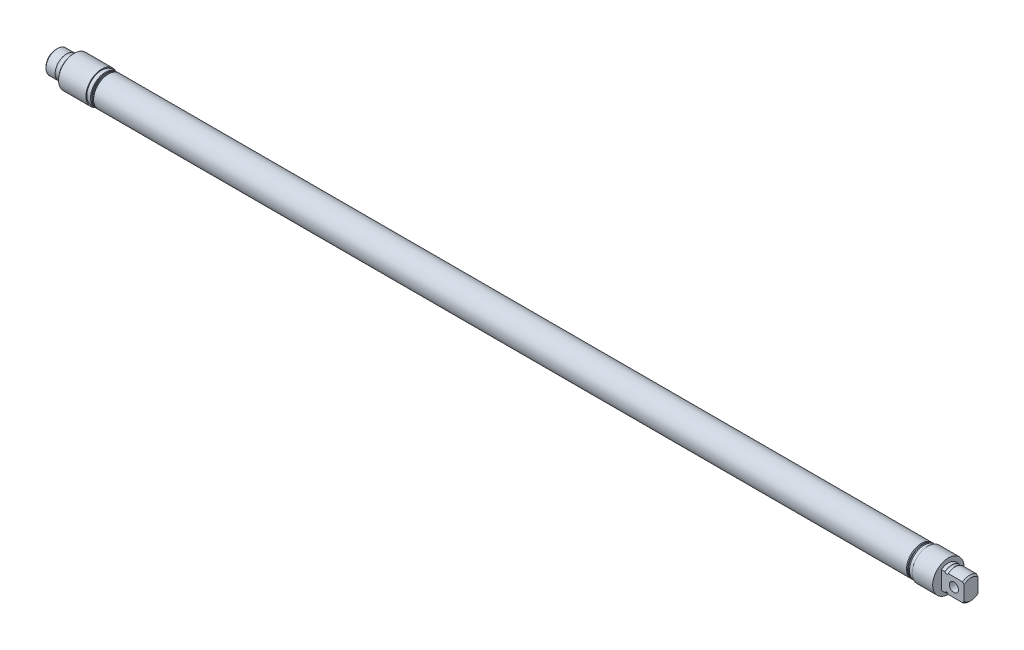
ISO-10303-21;
HEADER;
FILE_DESCRIPTION(('STEP AP214'),'2;1');
FILE_NAME('part.step','',(''),(''),'','','');
FILE_SCHEMA(('AUTOMOTIVE_DESIGN { 1 0 10303 214 1 1 1 1 }'));
ENDSEC;
DATA;
#1=APPLICATION_CONTEXT('core data for automotive mechanical design processes');
#2=APPLICATION_PROTOCOL_DEFINITION('international standard','automotive_design',2000,#1);
#3=PRODUCT_CONTEXT('',#1,'mechanical');
#4=PRODUCT('Part','Part','',(#3));
#5=PRODUCT_RELATED_PRODUCT_CATEGORY('part','',(#4));
#6=PRODUCT_DEFINITION_FORMATION('','',#4);
#7=PRODUCT_DEFINITION_CONTEXT('part definition',#1,'design');
#8=PRODUCT_DEFINITION('design','',#6,#7);
#9=PRODUCT_DEFINITION_SHAPE('','',#8);
#10=(LENGTH_UNIT() NAMED_UNIT(*) SI_UNIT(.MILLI.,.METRE.));
#11=(NAMED_UNIT(*) PLANE_ANGLE_UNIT() SI_UNIT($,.RADIAN.));
#12=(NAMED_UNIT(*) SI_UNIT($,.STERADIAN.) SOLID_ANGLE_UNIT());
#13=UNCERTAINTY_MEASURE_WITH_UNIT(LENGTH_MEASURE(1.E-05),#10,'distance_accuracy_value','');
#14=(GEOMETRIC_REPRESENTATION_CONTEXT(3) GLOBAL_UNCERTAINTY_ASSIGNED_CONTEXT((#13)) GLOBAL_UNIT_ASSIGNED_CONTEXT((#10,
#11,#12)) REPRESENTATION_CONTEXT('',''));
#15=CARTESIAN_POINT('',(0.,0.,0.));
#16=DIRECTION('',(0.,0.,1.));
#17=DIRECTION('',(1.,0.,0.));
#18=AXIS2_PLACEMENT_3D('',#15,#16,#17);
#19=CARTESIAN_POINT('',(-21.4174471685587,0.,0.));
#20=DIRECTION('',(-1.,0.,0.));
#21=DIRECTION('',(0.,0.,1.));
#22=AXIS2_PLACEMENT_3D('',#19,#20,#21);
#23=CYLINDRICAL_SURFACE('',#22,10.287);
#24=CARTESIAN_POINT('',(601.98,0.,0.));
#25=DIRECTION('',(-1.,0.,0.));
#26=DIRECTION('',(0.,0.,1.));
#27=AXIS2_PLACEMENT_3D('',#24,#25,#26);
#28=CIRCLE('',#27,10.2870000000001);
#29=CARTESIAN_POINT('',(601.98,0.,10.2870000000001));
#30=VERTEX_POINT('',#29);
#31=EDGE_CURVE('E356',#30,#30,#28,.T.);
#32=ORIENTED_EDGE('',*,*,#31,.F.);
#33=EDGE_LOOP('',(#32));
#34=FACE_BOUND('',#33,.T.);
#35=CARTESIAN_POINT('',(602.488,0.,0.));
#36=DIRECTION('',(-1.,0.,0.));
#37=DIRECTION('',(0.,0.,1.));
#38=AXIS2_PLACEMENT_3D('',#35,#36,#37);
#39=CIRCLE('',#38,10.2870000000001);
#40=CARTESIAN_POINT('',(602.488,0.,10.2870000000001));
#41=VERTEX_POINT('',#40);
#42=EDGE_CURVE('E345',#41,#41,#39,.T.);
#43=ORIENTED_EDGE('',*,*,#42,.T.);
#44=EDGE_LOOP('',(#43));
#45=FACE_BOUND('',#44,.T.);
#46=ADVANCED_FACE('F34',(#34,#45),#23,.T.);
#47=CARTESIAN_POINT('',(36.449,0.,0.));
#48=DIRECTION('',(-1.,0.,0.));
#49=DIRECTION('',(0.,0.,1.));
#50=AXIS2_PLACEMENT_3D('',#47,#48,#49);
#51=CIRCLE('',#50,10.287);
#52=CARTESIAN_POINT('',(36.449,0.,10.287));
#53=VERTEX_POINT('',#52);
#54=EDGE_CURVE('E240',#53,#53,#51,.T.);
#55=ORIENTED_EDGE('',*,*,#54,.F.);
#56=EDGE_LOOP('',(#55));
#57=FACE_BOUND('',#56,.T.);
#58=CARTESIAN_POINT('',(601.218,0.,0.));
#59=DIRECTION('',(-1.,0.,0.));
#60=DIRECTION('',(0.,0.,1.));
#61=AXIS2_PLACEMENT_3D('',#58,#59,#60);
#62=CIRCLE('',#61,10.2870000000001);
#63=CARTESIAN_POINT('',(601.218,0.,10.2870000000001));
#64=VERTEX_POINT('',#63);
#65=EDGE_CURVE('E359',#64,#64,#62,.T.);
#66=ORIENTED_EDGE('',*,*,#65,.T.);
#67=EDGE_LOOP('',(#66));
#68=FACE_BOUND('',#67,.T.);
#69=ADVANCED_FACE('F318',(#57,#68),#23,.T.);
#70=CARTESIAN_POINT('',(35.179,0.,0.));
#71=DIRECTION('',(-1.,0.,0.));
#72=DIRECTION('',(0.,0.,1.));
#73=AXIS2_PLACEMENT_3D('',#70,#71,#72);
#74=CIRCLE('',#73,10.287);
#75=CARTESIAN_POINT('',(35.179,0.,10.287));
#76=VERTEX_POINT('',#75);
#77=EDGE_CURVE('E249',#76,#76,#74,.T.);
#78=ORIENTED_EDGE('',*,*,#77,.F.);
#79=EDGE_LOOP('',(#78));
#80=FACE_BOUND('',#79,.T.);
#81=CARTESIAN_POINT('',(35.56,0.,0.));
#82=DIRECTION('',(-1.,0.,0.));
#83=DIRECTION('',(0.,0.,1.));
#84=AXIS2_PLACEMENT_3D('',#81,#82,#83);
#85=CIRCLE('',#84,10.287);
#86=CARTESIAN_POINT('',(35.56,0.,10.287));
#87=VERTEX_POINT('',#86);
#88=EDGE_CURVE('E246',#87,#87,#85,.T.);
#89=ORIENTED_EDGE('',*,*,#88,.T.);
#90=EDGE_LOOP('',(#89));
#91=FACE_BOUND('',#90,.T.);
#92=ADVANCED_FACE('F303',(#80,#91),#23,.T.);
#93=CARTESIAN_POINT('',(31.75,0.,0.));
#94=DIRECTION('',(-1.,0.,0.));
#95=DIRECTION('',(0.,0.,1.));
#96=AXIS2_PLACEMENT_3D('',#93,#94,#95);
#97=CIRCLE('',#96,10.287);
#98=CARTESIAN_POINT('',(31.75,0.,10.287));
#99=VERTEX_POINT('',#98);
#100=EDGE_CURVE('E264',#99,#99,#97,.T.);
#101=ORIENTED_EDGE('',*,*,#100,.F.);
#102=EDGE_LOOP('',(#101));
#103=FACE_BOUND('',#102,.T.);
#104=CARTESIAN_POINT('',(34.29,0.,0.));
#105=DIRECTION('',(-1.,0.,0.));
#106=DIRECTION('',(0.,0.,1.));
#107=AXIS2_PLACEMENT_3D('',#104,#105,#106);
#108=CIRCLE('',#107,10.287);
#109=CARTESIAN_POINT('',(34.29,0.,10.287));
#110=VERTEX_POINT('',#109);
#111=EDGE_CURVE('E255',#110,#110,#108,.T.);
#112=ORIENTED_EDGE('',*,*,#111,.T.);
#113=EDGE_LOOP('',(#112));
#114=FACE_BOUND('',#113,.T.);
#115=ADVANCED_FACE('F284',(#103,#114),#23,.T.);
#116=CARTESIAN_POINT('',(12.7,10.922,0.));
#117=DIRECTION('',(1.,0.,0.));
#118=DIRECTION('',(0.,0.,-1.));
#119=AXIS2_PLACEMENT_3D('',#116,#117,#118);
#120=PLANE('',#119);
#121=CARTESIAN_POINT('',(12.7,0.,0.));
#122=DIRECTION('',(-1.,0.,0.));
#123=DIRECTION('',(0.,0.,1.));
#124=AXIS2_PLACEMENT_3D('',#121,#122,#123);
#125=CIRCLE('',#124,7.9375);
#126=CARTESIAN_POINT('',(12.7,0.,7.9375));
#127=VERTEX_POINT('',#126);
#128=EDGE_CURVE('E144',#127,#127,#125,.T.);
#129=ORIENTED_EDGE('',*,*,#128,.F.);
#130=EDGE_LOOP('',(#129));
#131=FACE_BOUND('',#130,.T.);
#132=CARTESIAN_POINT('',(12.7,0.,0.));
#133=DIRECTION('',(-1.,0.,0.));
#134=DIRECTION('',(0.,0.,1.));
#135=AXIS2_PLACEMENT_3D('',#132,#133,#134);
#136=CIRCLE('',#135,10.922);
#137=CARTESIAN_POINT('',(12.7,0.,10.922));
#138=VERTEX_POINT('',#137);
#139=EDGE_CURVE('E258',#138,#138,#136,.T.);
#140=ORIENTED_EDGE('',*,*,#139,.T.);
#141=EDGE_LOOP('',(#140));
#142=FACE_BOUND('',#141,.T.);
#143=ADVANCED_FACE('F281',(#131,#142),#120,.F.);
#144=CARTESIAN_POINT('',(-21.4174471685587,0.,0.));
#145=DIRECTION('',(-1.,0.,0.));
#146=DIRECTION('',(0.,0.,1.));
#147=AXIS2_PLACEMENT_3D('',#144,#145,#146);
#148=CYLINDRICAL_SURFACE('',#147,7.9375);
#149=CARTESIAN_POINT('',(10.414,0.,0.));
#150=DIRECTION('',(-1.,0.,0.));
#151=DIRECTION('',(0.,0.,1.));
#152=AXIS2_PLACEMENT_3D('',#149,#150,#151);
#153=CIRCLE('',#152,7.9375);
#154=CARTESIAN_POINT('',(10.414,0.,7.9375));
#155=VERTEX_POINT('',#154);
#156=EDGE_CURVE('E362',#155,#155,#153,.T.);
#157=ORIENTED_EDGE('',*,*,#156,.F.);
#158=EDGE_LOOP('',(#157));
#159=FACE_BOUND('',#158,.T.);
#160=ORIENTED_EDGE('',*,*,#128,.T.);
#161=EDGE_LOOP('',(#160));
#162=FACE_BOUND('',#161,.T.);
#163=ADVANCED_FACE('F279',(#159,#162),#148,.T.);
#164=CARTESIAN_POINT('',(31.75,10.922,0.));
#165=DIRECTION('',(-1.,0.,0.));
#166=DIRECTION('',(0.,0.,1.));
#167=AXIS2_PLACEMENT_3D('',#164,#165,#166);
#168=PLANE('',#167);
#169=CARTESIAN_POINT('',(31.75,0.,0.));
#170=DIRECTION('',(-1.,0.,0.));
#171=DIRECTION('',(0.,0.,1.));
#172=AXIS2_PLACEMENT_3D('',#169,#170,#171);
#173=CIRCLE('',#172,10.922);
#174=CARTESIAN_POINT('',(31.75,0.,10.922));
#175=VERTEX_POINT('',#174);
#176=EDGE_CURVE('E261',#175,#175,#173,.T.);
#177=ORIENTED_EDGE('',*,*,#176,.F.);
#178=EDGE_LOOP('',(#177));
#179=FACE_BOUND('',#178,.T.);
#180=ORIENTED_EDGE('',*,*,#100,.T.);
#181=EDGE_LOOP('',(#180));
#182=FACE_BOUND('',#181,.T.);
#183=ADVANCED_FACE('F292',(#179,#182),#168,.F.);
#184=CARTESIAN_POINT('',(-21.4174471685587,0.,0.));
#185=DIRECTION('',(-1.,0.,0.));
#186=DIRECTION('',(0.,0.,1.));
#187=AXIS2_PLACEMENT_3D('',#184,#185,#186);
#188=CYLINDRICAL_SURFACE('',#187,10.922);
#189=ORIENTED_EDGE('',*,*,#139,.F.);
#190=EDGE_LOOP('',(#189));
#191=FACE_BOUND('',#190,.T.);
#192=ORIENTED_EDGE('',*,*,#176,.T.);
#193=EDGE_LOOP('',(#192));
#194=FACE_BOUND('',#193,.T.);
#195=ADVANCED_FACE('F288',(#191,#194),#188,.T.);
#196=CARTESIAN_POINT('',(34.29,10.287,0.));
#197=DIRECTION('',(1.,0.,0.));
#198=DIRECTION('',(0.,0.,-1.));
#199=AXIS2_PLACEMENT_3D('',#196,#197,#198);
#200=PLANE('',#199);
#201=CARTESIAN_POINT('',(34.29,0.,0.));
#202=DIRECTION('',(-1.,0.,0.));
#203=DIRECTION('',(0.,0.,1.));
#204=AXIS2_PLACEMENT_3D('',#201,#202,#203);
#205=CIRCLE('',#204,9.39799999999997);
#206=CARTESIAN_POINT('',(34.29,0.,9.39799999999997));
#207=VERTEX_POINT('',#206);
#208=EDGE_CURVE('E252',#207,#207,#205,.T.);
#209=ORIENTED_EDGE('',*,*,#208,.T.);
#210=EDGE_LOOP('',(#209));
#211=FACE_BOUND('',#210,.T.);
#212=ORIENTED_EDGE('',*,*,#111,.F.);
#213=EDGE_LOOP('',(#212));
#214=FACE_BOUND('',#213,.T.);
#215=ADVANCED_FACE('F291',(#211,#214),#200,.T.);
#216=CARTESIAN_POINT('',(34.29,0.,0.));
#217=DIRECTION('',(1.,0.,0.));
#218=DIRECTION('',(0.,0.,-1.));
#219=AXIS2_PLACEMENT_3D('',#216,#217,#218);
#220=CONICAL_SURFACE('',#219,9.39799999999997,0.785398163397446);
#221=ORIENTED_EDGE('',*,*,#77,.T.);
#222=EDGE_LOOP('',(#221));
#223=FACE_BOUND('',#222,.T.);
#224=ORIENTED_EDGE('',*,*,#208,.F.);
#225=EDGE_LOOP('',(#224));
#226=FACE_BOUND('',#225,.T.);
#227=ADVANCED_FACE('F308',(#223,#226),#220,.T.);
#228=CARTESIAN_POINT('',(35.56,10.287,0.));
#229=DIRECTION('',(1.,0.,0.));
#230=DIRECTION('',(0.,0.,-1.));
#231=AXIS2_PLACEMENT_3D('',#228,#229,#230);
#232=PLANE('',#231);
#233=CARTESIAN_POINT('',(35.56,0.,0.));
#234=DIRECTION('',(-1.,0.,0.));
#235=DIRECTION('',(0.,0.,1.));
#236=AXIS2_PLACEMENT_3D('',#233,#234,#235);
#237=CIRCLE('',#236,9.39799999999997);
#238=CARTESIAN_POINT('',(35.56,0.,9.39799999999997));
#239=VERTEX_POINT('',#238);
#240=EDGE_CURVE('E243',#239,#239,#237,.T.);
#241=ORIENTED_EDGE('',*,*,#240,.T.);
#242=EDGE_LOOP('',(#241));
#243=FACE_BOUND('',#242,.T.);
#244=ORIENTED_EDGE('',*,*,#88,.F.);
#245=EDGE_LOOP('',(#244));
#246=FACE_BOUND('',#245,.T.);
#247=ADVANCED_FACE('F314',(#243,#246),#232,.T.);
#248=CARTESIAN_POINT('',(35.56,0.,0.));
#249=DIRECTION('',(1.,0.,0.));
#250=DIRECTION('',(0.,0.,-1.));
#251=AXIS2_PLACEMENT_3D('',#248,#249,#250);
#252=CONICAL_SURFACE('',#251,9.39799999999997,0.785398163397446);
#253=ORIENTED_EDGE('',*,*,#54,.T.);
#254=EDGE_LOOP('',(#253));
#255=FACE_BOUND('',#254,.T.);
#256=ORIENTED_EDGE('',*,*,#240,.F.);
#257=EDGE_LOOP('',(#256));
#258=FACE_BOUND('',#257,.T.);
#259=ADVANCED_FACE('F476',(#255,#258),#252,.T.);
#260=CARTESIAN_POINT('',(8.89,0.,0.));
#261=DIRECTION('',(-1.,0.,0.));
#262=DIRECTION('',(0.,0.,1.));
#263=AXIS2_PLACEMENT_3D('',#260,#261,#262);
#264=TOROIDAL_SURFACE('',#263,9.28154166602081,2.032);
#265=CARTESIAN_POINT('',(7.366,0.,0.));
#266=DIRECTION('',(-1.,0.,0.));
#267=DIRECTION('',(0.,0.,1.));
#268=AXIS2_PLACEMENT_3D('',#265,#266,#267);
#269=CIRCLE('',#268,7.9375);
#270=CARTESIAN_POINT('',(7.366,0.,7.9375));
#271=VERTEX_POINT('',#270);
#272=EDGE_CURVE('E365',#271,#271,#269,.T.);
#273=ORIENTED_EDGE('',*,*,#272,.F.);
#274=EDGE_LOOP('',(#273));
#275=FACE_BOUND('',#274,.T.);
#276=ORIENTED_EDGE('',*,*,#156,.T.);
#277=EDGE_LOOP('',(#276));
#278=FACE_BOUND('',#277,.T.);
#279=ADVANCED_FACE('F486',(#275,#278),#264,.F.);
#280=CARTESIAN_POINT('',(589.407,0.,0.));
#281=DIRECTION('',(1.,0.,0.));
#282=DIRECTION('',(0.,0.,-1.));
#283=AXIS2_PLACEMENT_3D('',#280,#281,#282);
#284=PLANE('',#283);
#285=CARTESIAN_POINT('',(589.407,0.,0.));
#286=DIRECTION('',(1.,0.,0.));
#287=DIRECTION('',(0.,0.,-1.));
#288=AXIS2_PLACEMENT_3D('',#285,#286,#287);
#289=CIRCLE('',#288,9.52500000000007);
#290=CARTESIAN_POINT('',(589.407,0.,-9.52500000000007));
#291=VERTEX_POINT('',#290);
#292=EDGE_CURVE('E237',#291,#291,#289,.T.);
#293=ORIENTED_EDGE('',*,*,#292,.F.);
#294=EDGE_LOOP('',(#293));
#295=FACE_BOUND('',#294,.T.);
#296=ADVANCED_FACE('F494',(#295),#284,.F.);
#297=CARTESIAN_POINT('',(0.,0.,0.));
#298=DIRECTION('',(1.,0.,0.));
#299=DIRECTION('',(0.,0.,-1.));
#300=AXIS2_PLACEMENT_3D('',#297,#298,#299);
#301=CYLINDRICAL_SURFACE('',#300,9.52500000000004);
#302=CARTESIAN_POINT('',(43.307,0.,0.));
#303=DIRECTION('',(1.,0.,0.));
#304=DIRECTION('',(0.,0.,-1.));
#305=AXIS2_PLACEMENT_3D('',#302,#303,#304);
#306=CIRCLE('',#305,9.52500000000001);
#307=CARTESIAN_POINT('',(43.307,0.,-9.52500000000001));
#308=VERTEX_POINT('',#307);
#309=EDGE_CURVE('E234',#308,#308,#306,.T.);
#310=ORIENTED_EDGE('',*,*,#309,.F.);
#311=EDGE_LOOP('',(#310));
#312=FACE_BOUND('',#311,.T.);
#313=ORIENTED_EDGE('',*,*,#292,.T.);
#314=EDGE_LOOP('',(#313));
#315=FACE_BOUND('',#314,.T.);
#316=ADVANCED_FACE('F498',(#312,#315),#301,.F.);
#317=CARTESIAN_POINT('',(43.307,9.52500000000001,0.));
#318=DIRECTION('',(-1.,0.,0.));
#319=DIRECTION('',(0.,0.,1.));
#320=AXIS2_PLACEMENT_3D('',#317,#318,#319);
#321=PLANE('',#320);
#322=CARTESIAN_POINT('',(43.307,0.,0.));
#323=DIRECTION('',(1.,0.,0.));
#324=DIRECTION('',(0.,0.,-1.));
#325=AXIS2_PLACEMENT_3D('',#322,#323,#324);
#326=CIRCLE('',#325,3.17500000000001);
#327=CARTESIAN_POINT('',(43.307,0.,-3.17500000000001));
#328=VERTEX_POINT('',#327);
#329=EDGE_CURVE('E231',#328,#328,#326,.T.);
#330=ORIENTED_EDGE('',*,*,#329,.F.);
#331=EDGE_LOOP('',(#330));
#332=FACE_BOUND('',#331,.T.);
#333=ORIENTED_EDGE('',*,*,#309,.T.);
#334=EDGE_LOOP('',(#333));
#335=FACE_BOUND('',#334,.T.);
#336=ADVANCED_FACE('F508',(#332,#335),#321,.F.);
#337=CARTESIAN_POINT('',(0.,0.,0.));
#338=DIRECTION('',(1.,0.,0.));
#339=DIRECTION('',(0.,0.,-1.));
#340=AXIS2_PLACEMENT_3D('',#337,#338,#339);
#341=CYLINDRICAL_SURFACE('',#340,3.175);
#342=CARTESIAN_POINT('',(0.,0.,0.));
#343=DIRECTION('',(1.,0.,0.));
#344=DIRECTION('',(0.,0.,-1.));
#345=AXIS2_PLACEMENT_3D('',#342,#343,#344);
#346=CIRCLE('',#345,3.175);
#347=CARTESIAN_POINT('',(0.,0.,-3.175));
#348=VERTEX_POINT('',#347);
#349=EDGE_CURVE('E228',#348,#348,#346,.T.);
#350=ORIENTED_EDGE('',*,*,#349,.F.);
#351=EDGE_LOOP('',(#350));
#352=FACE_BOUND('',#351,.T.);
#353=ORIENTED_EDGE('',*,*,#329,.T.);
#354=EDGE_LOOP('',(#353));
#355=FACE_BOUND('',#354,.T.);
#356=ADVANCED_FACE('F412',(#352,#355),#341,.F.);
#357=CARTESIAN_POINT('',(0.,7.9375,0.));
#358=DIRECTION('',(1.,0.,0.));
#359=DIRECTION('',(0.,0.,-1.));
#360=AXIS2_PLACEMENT_3D('',#357,#358,#359);
#361=PLANE('',#360);
#362=CARTESIAN_POINT('',(0.,0.,0.));
#363=DIRECTION('',(1.,0.,0.));
#364=DIRECTION('',(0.,0.,-1.));
#365=AXIS2_PLACEMENT_3D('',#362,#363,#364);
#366=CIRCLE('',#365,6.9215);
#367=CARTESIAN_POINT('',(0.,0.,-6.9215));
#368=VERTEX_POINT('',#367);
#369=EDGE_CURVE('E42',#368,#368,#366,.F.);
#370=ORIENTED_EDGE('',*,*,#369,.T.);
#371=EDGE_LOOP('',(#370));
#372=FACE_BOUND('',#371,.T.);
#373=ORIENTED_EDGE('',*,*,#349,.T.);
#374=EDGE_LOOP('',(#373));
#375=FACE_BOUND('',#374,.T.);
#376=ADVANCED_FACE('F409',(#372,#375),#361,.F.);
#377=CARTESIAN_POINT('',(1.016,0.,0.));
#378=DIRECTION('',(1.,0.,0.));
#379=DIRECTION('',(0.,0.,-1.));
#380=AXIS2_PLACEMENT_3D('',#377,#378,#379);
#381=CIRCLE('',#380,7.9375);
#382=CARTESIAN_POINT('',(1.016,0.,-7.9375));
#383=VERTEX_POINT('',#382);
#384=EDGE_CURVE('E12',#383,#383,#381,.T.);
#385=ORIENTED_EDGE('',*,*,#384,.T.);
#386=EDGE_LOOP('',(#385));
#387=FACE_BOUND('',#386,.T.);
#388=ORIENTED_EDGE('',*,*,#272,.T.);
#389=EDGE_LOOP('',(#388));
#390=FACE_BOUND('',#389,.T.);
#391=ADVANCED_FACE('F408',(#387,#390),#148,.T.);
#392=CARTESIAN_POINT('',(601.218,0.,0.));
#393=DIRECTION('',(-1.,0.,0.));
#394=DIRECTION('',(0.,0.,1.));
#395=AXIS2_PLACEMENT_3D('',#392,#393,#394);
#396=CONICAL_SURFACE('',#395,10.2870000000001,0.785398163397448);
#397=CARTESIAN_POINT('',(601.98,0.,0.));
#398=DIRECTION('',(-1.,0.,0.));
#399=DIRECTION('',(0.,0.,1.));
#400=AXIS2_PLACEMENT_3D('',#397,#398,#399);
#401=CIRCLE('',#400,9.52500000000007);
#402=CARTESIAN_POINT('',(601.98,0.,9.52500000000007));
#403=VERTEX_POINT('',#402);
#404=EDGE_CURVE('E349',#403,#403,#401,.T.);
#405=ORIENTED_EDGE('',*,*,#404,.T.);
#406=EDGE_LOOP('',(#405));
#407=FACE_BOUND('',#406,.T.);
#408=ORIENTED_EDGE('',*,*,#65,.F.);
#409=EDGE_LOOP('',(#408));
#410=FACE_BOUND('',#409,.T.);
#411=ADVANCED_FACE('F610',(#407,#410),#396,.T.);
#412=CARTESIAN_POINT('',(601.98,10.2870000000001,0.));
#413=DIRECTION('',(-1.,0.,0.));
#414=DIRECTION('',(0.,0.,1.));
#415=AXIS2_PLACEMENT_3D('',#412,#413,#414);
#416=PLANE('',#415);
#417=ORIENTED_EDGE('',*,*,#31,.T.);
#418=EDGE_LOOP('',(#417));
#419=FACE_BOUND('',#418,.T.);
#420=ORIENTED_EDGE('',*,*,#404,.F.);
#421=EDGE_LOOP('',(#420));
#422=FACE_BOUND('',#421,.T.);
#423=ADVANCED_FACE('F614',(#419,#422),#416,.T.);
#424=CARTESIAN_POINT('',(602.488,0.,0.));
#425=DIRECTION('',(-1.,0.,0.));
#426=DIRECTION('',(0.,0.,1.));
#427=AXIS2_PLACEMENT_3D('',#424,#425,#426);
#428=CONICAL_SURFACE('',#427,10.2870000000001,0.785398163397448);
#429=CARTESIAN_POINT('',(603.25,0.,0.));
#430=DIRECTION('',(-1.,0.,0.));
#431=DIRECTION('',(0.,0.,1.));
#432=AXIS2_PLACEMENT_3D('',#429,#430,#431);
#433=CIRCLE('',#432,9.52500000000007);
#434=CARTESIAN_POINT('',(603.25,0.,9.52500000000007));
#435=VERTEX_POINT('',#434);
#436=EDGE_CURVE('E346',#435,#435,#433,.T.);
#437=ORIENTED_EDGE('',*,*,#436,.T.);
#438=EDGE_LOOP('',(#437));
#439=FACE_BOUND('',#438,.T.);
#440=ORIENTED_EDGE('',*,*,#42,.F.);
#441=EDGE_LOOP('',(#440));
#442=FACE_BOUND('',#441,.T.);
#443=ADVANCED_FACE('F625',(#439,#442),#428,.T.);
#444=CARTESIAN_POINT('',(603.25,10.2870000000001,0.));
#445=DIRECTION('',(-1.,0.,0.));
#446=DIRECTION('',(0.,0.,1.));
#447=AXIS2_PLACEMENT_3D('',#444,#445,#446);
#448=PLANE('',#447);
#449=CARTESIAN_POINT('',(603.25,0.,0.));
#450=DIRECTION('',(-1.,0.,0.));
#451=DIRECTION('',(0.,0.,1.));
#452=AXIS2_PLACEMENT_3D('',#449,#450,#451);
#453=CIRCLE('',#452,10.2870000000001);
#454=CARTESIAN_POINT('',(603.25,0.,10.2870000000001));
#455=VERTEX_POINT('',#454);
#456=EDGE_CURVE('E343',#455,#455,#453,.T.);
#457=ORIENTED_EDGE('',*,*,#456,.T.);
#458=EDGE_LOOP('',(#457));
#459=FACE_BOUND('',#458,.T.);
#460=ORIENTED_EDGE('',*,*,#436,.F.);
#461=EDGE_LOOP('',(#460));
#462=FACE_BOUND('',#461,.T.);
#463=ADVANCED_FACE('F202',(#459,#462),#448,.T.);
#464=CARTESIAN_POINT('',(623.57,0.,0.));
#465=DIRECTION('',(-1.,0.,0.));
#466=DIRECTION('',(0.,0.,1.));
#467=AXIS2_PLACEMENT_3D('',#464,#465,#466);
#468=TOROIDAL_SURFACE('',#467,8.49108016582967,1.27);
#469=CARTESIAN_POINT('',(624.713,0.,0.));
#470=DIRECTION('',(-1.,0.,0.));
#471=DIRECTION('',(0.,0.,1.));
#472=AXIS2_PLACEMENT_3D('',#469,#470,#471);
#473=CIRCLE('',#472,7.93750000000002);
#474=CARTESIAN_POINT('',(624.713,6.30187513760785,4.826));
#475=VERTEX_POINT('',#474);
#476=CARTESIAN_POINT('',(624.713,6.30187513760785,-4.826));
#477=VERTEX_POINT('',#476);
#478=EDGE_CURVE('E221',#475,#477,#473,.T.);
#479=ORIENTED_EDGE('',*,*,#478,.T.);
#480=CARTESIAN_POINT('',(623.176655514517,5.45522840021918,-4.826));
#481=CARTESIAN_POINT('',(623.109420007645,5.48447214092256,-4.826));
#482=CARTESIAN_POINT('',(623.045186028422,5.52063367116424,-4.826));
#483=CARTESIAN_POINT('',(622.924174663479,5.60380381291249,-4.826));
#484=CARTESIAN_POINT('',(622.867412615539,5.65083420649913,-4.826));
#485=CARTESIAN_POINT('',(622.762443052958,5.75257635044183,-4.826));
#486=CARTESIAN_POINT('',(622.714156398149,5.80720743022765,-4.826));
#487=CARTESIAN_POINT('',(622.625555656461,5.92249021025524,-4.826));
#488=CARTESIAN_POINT('',(622.585238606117,5.98313965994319,-4.826));
#489=CARTESIAN_POINT('',(622.504833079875,6.12226393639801,-4.826));
#490=CARTESIAN_POINT('',(622.466582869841,6.20180195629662,-4.826));
#491=CARTESIAN_POINT('',(622.40165523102,6.36549199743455,-4.826));
#492=CARTESIAN_POINT('',(622.374988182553,6.4496480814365,-4.826));
#493=CARTESIAN_POINT('',(622.32972397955,6.63603683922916,-4.826));
#494=CARTESIAN_POINT('',(622.313396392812,6.73882869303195,-4.826));
#495=CARTESIAN_POINT('',(622.297602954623,6.94578115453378,-4.826));
#496=CARTESIAN_POINT('',(622.298149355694,7.04994270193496,-4.826));
#497=CARTESIAN_POINT('',(622.317178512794,7.25998338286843,-4.826));
#498=CARTESIAN_POINT('',(622.336224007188,7.36581372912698,-4.826));
#499=CARTESIAN_POINT('',(622.393920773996,7.57196677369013,-4.826));
#500=CARTESIAN_POINT('',(622.432538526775,7.67229856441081,-4.826));
#501=CARTESIAN_POINT('',(622.51677984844,7.8375480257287,-4.826));
#502=CARTESIAN_POINT('',(622.557837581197,7.90480634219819,-4.826));
#503=CARTESIAN_POINT('',(622.650500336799,8.03166878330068,-4.826));
#504=CARTESIAN_POINT('',(622.702100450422,8.09127644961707,-4.826));
#505=CARTESIAN_POINT('',(622.815520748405,8.20075693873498,-4.826));
#506=CARTESIAN_POINT('',(622.877407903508,8.25056096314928,-4.826));
#507=CARTESIAN_POINT('',(623.009650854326,8.33730816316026,-4.826));
#508=CARTESIAN_POINT('',(623.080000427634,8.37426071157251,-4.826));
#509=CARTESIAN_POINT('',(623.217708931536,8.42941397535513,-4.826));
#510=CARTESIAN_POINT('',(623.284368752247,8.44936389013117,-4.826));
#511=CARTESIAN_POINT('',(623.42022203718,8.47656559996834,-4.826));
#512=CARTESIAN_POINT('',(623.489413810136,8.48382571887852,-4.826));
#513=CARTESIAN_POINT('',(623.62176584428,8.48519123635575,-4.826));
#514=CARTESIAN_POINT('',(623.684917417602,8.4804050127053,-4.826));
#515=CARTESIAN_POINT('',(623.80948403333,8.46020188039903,-4.826));
#516=CARTESIAN_POINT('',(623.870899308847,8.44478640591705,-4.826));
#517=CARTESIAN_POINT('',(623.989881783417,8.40418192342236,-4.826));
#518=CARTESIAN_POINT('',(624.047473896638,8.37906540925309,-4.826));
#519=CARTESIAN_POINT('',(624.157976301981,8.320090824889,-4.826));
#520=CARTESIAN_POINT('',(624.21088564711,8.28623099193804,-4.826));
#521=CARTESIAN_POINT('',(624.314303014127,8.2085372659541,-4.826));
#522=CARTESIAN_POINT('',(624.36442929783,8.16419685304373,-4.826));
#523=CARTESIAN_POINT('',(624.457483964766,8.06853735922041,-4.826));
#524=CARTESIAN_POINT('',(624.500409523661,8.01721555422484,-4.826));
#525=CARTESIAN_POINT('',(624.583284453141,7.90267855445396,-4.826));
#526=CARTESIAN_POINT('',(624.622280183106,7.83877463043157,-4.826));
#527=CARTESIAN_POINT('',(624.690575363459,7.70599654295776,-4.826));
#528=CARTESIAN_POINT('',(624.719869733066,7.63711979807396,-4.826));
#529=CARTESIAN_POINT('',(624.772475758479,7.48556894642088,-4.826));
#530=CARTESIAN_POINT('',(624.794255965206,7.40236346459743,-4.826));
#531=CARTESIAN_POINT('',(624.825491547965,7.23368861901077,-4.826));
#532=CARTESIAN_POINT('',(624.834941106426,7.14821820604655,-4.826));
#533=CARTESIAN_POINT('',(624.842460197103,6.96429657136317,-4.826));
#534=CARTESIAN_POINT('',(624.838672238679,6.86576745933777,-4.826));
#535=CARTESIAN_POINT('',(624.816081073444,6.67037257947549,-4.826));
#536=CARTESIAN_POINT('',(624.797261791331,6.57350870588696,-4.826));
#537=CARTESIAN_POINT('',(624.742631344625,6.37514774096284,-4.826));
#538=CARTESIAN_POINT('',(624.705431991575,6.27402902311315,-4.826));
#539=CARTESIAN_POINT('',(624.613823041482,6.0798849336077,-4.826));
#540=CARTESIAN_POINT('',(624.559432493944,5.98685074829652,-4.826));
#541=CARTESIAN_POINT('',(624.451560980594,5.83822087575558,-4.826));
#542=CARTESIAN_POINT('',(624.402306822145,5.77954756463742,-4.826));
#543=CARTESIAN_POINT('',(624.295116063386,5.67075199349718,-4.826));
#544=CARTESIAN_POINT('',(624.237193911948,5.62061579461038,-4.826));
#545=CARTESIAN_POINT('',(624.125583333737,5.54061144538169,-4.826));
#546=CARTESIAN_POINT('',(624.073368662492,5.50869509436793,-4.826));
#547=CARTESIAN_POINT('',(623.964384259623,5.45384086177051,-4.826));
#548=CARTESIAN_POINT('',(623.907617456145,5.43089726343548,-4.826));
#549=CARTESIAN_POINT('',(623.790383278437,5.3955065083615,-4.826));
#550=CARTESIAN_POINT('',(623.729891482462,5.38313883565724,-4.826));
#551=CARTESIAN_POINT('',(623.607666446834,5.37033512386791,-4.826));
#552=CARTESIAN_POINT('',(623.54593410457,5.36989075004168,-4.826));
#553=CARTESIAN_POINT('',(623.431708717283,5.3802064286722,-4.826));
#554=CARTESIAN_POINT('',(623.37907510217,5.38948993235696,-4.826));
#555=CARTESIAN_POINT('',(623.275983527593,5.41637081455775,-4.826));
#556=CARTESIAN_POINT('',(623.22552661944,5.4339721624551,-4.826));
#557=CARTESIAN_POINT('',(623.176655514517,5.45522840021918,-4.826));
#558=B_SPLINE_CURVE_WITH_KNOTS('',3,(#480,#481,#482,#483,#484,#485,#486,#487,#488,#489,#490,
#491,#492,#493,#494,#495,#496,#497,#498,#499,#500,#501,#502,#503,#504,#505,#506,#507,#508,#509,
#510,#511,#512,#513,#514,#515,#516,#517,#518,#519,#520,#521,#522,#523,#524,#525,#526,#527,#528,
#529,#530,#531,#532,#533,#534,#535,#536,#537,#538,#539,#540,#541,#542,#543,#544,#545,#546,#547,
#548,#549,#550,#551,#552,#553,#554,#555,#556,#557),.UNSPECIFIED.,.T.,.F.,(4,2,2,2,2,2,2,2,2,2,2,
2,2,2,2,2,2,2,2,2,2,2,2,2,2,2,2,2,2,2,2,2,2,2,2,2,2,2,4),(0.,0.219701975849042,
0.439848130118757,0.65781443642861,0.87569953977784,1.13949620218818,1.40352878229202,
1.71438170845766,2.02546035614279,2.34630818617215,2.66660837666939,2.9020597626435,
3.13740175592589,3.37434061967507,3.6111063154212,3.81870620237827,4.02616986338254,
4.21525467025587,4.40431396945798,4.59198698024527,4.77969785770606,4.97965257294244,
5.17968553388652,5.40339486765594,5.62722117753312,5.88424008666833,6.14138021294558,
6.43596420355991,6.73086366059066,7.05255049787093,7.37388211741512,7.6029093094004,
7.83155889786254,8.01443494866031,8.19719429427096,8.38131540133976,8.56530779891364,
8.72492512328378,8.88461869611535),.UNSPECIFIED.);
#559=CARTESIAN_POINT('',(622.427,6.30187513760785,-4.826));
#560=VERTEX_POINT('',#559);
#561=EDGE_CURVE('E186',#477,#560,#558,.T.);
#562=ORIENTED_EDGE('',*,*,#561,.T.);
#563=CARTESIAN_POINT('',(622.427,0.,0.));
#564=DIRECTION('',(-1.,0.,0.));
#565=DIRECTION('',(0.,0.,1.));
#566=AXIS2_PLACEMENT_3D('',#563,#564,#565);
#567=CIRCLE('',#566,7.93750000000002);
#568=CARTESIAN_POINT('',(622.427,6.30187513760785,4.826));
#569=VERTEX_POINT('',#568);
#570=EDGE_CURVE('E225',#569,#560,#567,.T.);
#571=ORIENTED_EDGE('',*,*,#570,.F.);
#572=CARTESIAN_POINT('',(623.176655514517,5.45522840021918,4.826));
#573=CARTESIAN_POINT('',(623.227111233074,5.43328339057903,4.826));
#574=CARTESIAN_POINT('',(623.279261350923,5.41523107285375,4.826));
#575=CARTESIAN_POINT('',(623.385841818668,5.38803813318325,4.826));
#576=CARTESIAN_POINT('',(623.440270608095,5.37889151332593,4.826));
#577=CARTESIAN_POINT('',(623.550040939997,5.3701746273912,4.826));
#578=CARTESIAN_POINT('',(623.605384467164,5.37062900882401,4.826));
#579=CARTESIAN_POINT('',(623.715149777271,5.3811375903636,4.826));
#580=CARTESIAN_POINT('',(623.76957136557,5.39119379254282,4.826));
#581=CARTESIAN_POINT('',(623.874579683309,5.41977879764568,4.826));
#582=CARTESIAN_POINT('',(623.92522940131,5.43807987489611,4.826));
#583=CARTESIAN_POINT('',(624.023232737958,5.48198974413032,4.826));
#584=CARTESIAN_POINT('',(624.070584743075,5.5076020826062,4.826));
#585=CARTESIAN_POINT('',(624.179252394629,5.5762482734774,4.826));
#586=CARTESIAN_POINT('',(624.238744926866,5.62217328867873,4.826));
#587=CARTESIAN_POINT('',(624.349504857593,5.72307524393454,4.826));
#588=CARTESIAN_POINT('',(624.400754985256,5.77807071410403,4.826));
#589=CARTESIAN_POINT('',(624.508016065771,5.91118580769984,4.826));
#590=CARTESIAN_POINT('',(624.561340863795,5.99146817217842,4.826));
#591=CARTESIAN_POINT('',(624.654203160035,6.1595702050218,4.826));
#592=CARTESIAN_POINT('',(624.693733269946,6.24739388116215,4.826));
#593=CARTESIAN_POINT('',(624.759402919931,6.42917384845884,4.826));
#594=CARTESIAN_POINT('',(624.785363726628,6.52319447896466,4.826));
#595=CARTESIAN_POINT('',(624.822838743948,6.71408764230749,4.826));
#596=CARTESIAN_POINT('',(624.834348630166,6.81096101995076,4.826));
#597=CARTESIAN_POINT('',(624.842841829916,7.01582940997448,4.826));
#598=CARTESIAN_POINT('',(624.838131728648,7.12390119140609,4.826));
#599=CARTESIAN_POINT('',(624.80946865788,7.33747556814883,4.826));
#600=CARTESIAN_POINT('',(624.785532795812,7.44298036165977,4.826));
#601=CARTESIAN_POINT('',(624.725005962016,7.62538430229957,4.826));
#602=CARTESIAN_POINT('',(624.692241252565,7.70355745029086,4.826));
#603=CARTESIAN_POINT('',(624.614267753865,7.85348574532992,4.826));
#604=CARTESIAN_POINT('',(624.569063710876,7.92524332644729,4.826));
#605=CARTESIAN_POINT('',(624.466114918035,8.06007558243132,4.826));
#606=CARTESIAN_POINT('',(624.408278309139,8.12308081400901,4.826));
#607=CARTESIAN_POINT('',(624.281337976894,8.23654246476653,4.826));
#608=CARTESIAN_POINT('',(624.212244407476,8.28701009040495,4.826));
#609=CARTESIAN_POINT('',(624.075121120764,8.36636861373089,4.826));
#610=CARTESIAN_POINT('',(624.008257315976,8.39727467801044,4.826));
#611=CARTESIAN_POINT('',(623.869854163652,8.44570527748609,4.826));
#612=CARTESIAN_POINT('',(623.798319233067,8.46324226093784,4.826));
#613=CARTESIAN_POINT('',(623.661743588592,8.48267492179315,4.826));
#614=CARTESIAN_POINT('',(623.596925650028,8.4861643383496,4.826));
#615=CARTESIAN_POINT('',(623.467689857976,8.48174520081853,4.826));
#616=CARTESIAN_POINT('',(623.403271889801,8.47384008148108,4.826));
#617=CARTESIAN_POINT('',(623.279165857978,8.44753682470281,4.826));
#618=CARTESIAN_POINT('',(623.219391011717,8.42954340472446,4.826));
#619=CARTESIAN_POINT('',(623.103537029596,8.38416014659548,4.826));
#620=CARTESIAN_POINT('',(623.047458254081,8.35676939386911,4.826));
#621=CARTESIAN_POINT('',(622.938023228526,8.29237576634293,4.826));
#622=CARTESIAN_POINT('',(622.884872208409,8.25502550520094,4.826));
#623=CARTESIAN_POINT('',(622.784869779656,8.17269794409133,4.826));
#624=CARTESIAN_POINT('',(622.738020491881,8.12771808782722,4.826));
#625=CARTESIAN_POINT('',(622.646825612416,8.02665777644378,4.826));
#626=CARTESIAN_POINT('',(622.603216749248,7.96991401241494,4.826));
#627=CARTESIAN_POINT('',(622.524776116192,7.85067221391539,4.826));
#628=CARTESIAN_POINT('',(622.489948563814,7.78817143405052,4.826));
#629=CARTESIAN_POINT('',(622.424885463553,7.64992991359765,4.826));
#630=CARTESIAN_POINT('',(622.395982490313,7.57356270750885,4.826));
#631=CARTESIAN_POINT('',(622.349530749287,7.41746760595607,4.826));
#632=CARTESIAN_POINT('',(622.331987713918,7.33773803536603,4.826));
#633=CARTESIAN_POINT('',(622.306101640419,7.16443591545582,4.826));
#634=CARTESIAN_POINT('',(622.299552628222,7.07059440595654,4.826));
#635=CARTESIAN_POINT('',(622.300495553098,6.8829547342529,4.826));
#636=CARTESIAN_POINT('',(622.307998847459,6.78915666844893,4.826));
#637=CARTESIAN_POINT('',(622.338270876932,6.59259802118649,4.826));
#638=CARTESIAN_POINT('',(622.362747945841,6.49009719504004,4.826));
#639=CARTESIAN_POINT('',(622.42827749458,6.29049934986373,4.826));
#640=CARTESIAN_POINT('',(622.469327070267,6.19340138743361,4.826));
#641=CARTESIAN_POINT('',(622.559093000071,6.02446584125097,4.826));
#642=CARTESIAN_POINT('',(622.605141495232,5.9512094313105,4.826));
#643=CARTESIAN_POINT('',(622.708417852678,5.8130008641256,4.826));
#644=CARTESIAN_POINT('',(622.765633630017,5.74803985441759,4.826));
#645=CARTESIAN_POINT('',(622.879485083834,5.64063342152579,4.826));
#646=CARTESIAN_POINT('',(622.934279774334,5.59624518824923,4.826));
#647=CARTESIAN_POINT('',(623.050690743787,5.51754807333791,4.826));
#648=CARTESIAN_POINT('',(623.112294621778,5.48322127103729,4.826));
#649=CARTESIAN_POINT('',(623.176655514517,5.45522840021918,4.826));
#650=B_SPLINE_CURVE_WITH_KNOTS('',3,(#572,#573,#574,#575,#576,#577,#578,#579,#580,#581,#582,
#583,#584,#585,#586,#587,#588,#589,#590,#591,#592,#593,#594,#595,#596,#597,#598,#599,#600,#601,
#602,#603,#604,#605,#606,#607,#608,#609,#610,#611,#612,#613,#614,#615,#616,#617,#618,#619,#620,
#621,#622,#623,#624,#625,#626,#627,#628,#629,#630,#631,#632,#633,#634,#635,#636,#637,#638,#639,
#640,#641,#642,#643,#644,#645,#646,#647,#648,#649),.UNSPECIFIED.,.T.,.F.,(4,2,2,2,2,2,2,2,2,2,2,
2,2,2,2,2,2,2,2,2,2,2,2,2,2,2,2,2,2,2,2,2,2,2,2,2,2,2,4),(0.,0.164869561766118,
0.329628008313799,0.494809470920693,0.660025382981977,0.820933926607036,0.981920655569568,
1.20615685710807,1.43085695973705,1.71848412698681,2.00626510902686,2.29774681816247,
2.58931573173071,2.91220767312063,3.23481261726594,3.4880718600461,3.74123460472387,
3.99630346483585,4.25114351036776,4.47085944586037,4.69037054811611,4.88412708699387,
5.0778252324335,5.26425772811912,5.45070837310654,5.64478662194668,5.83893002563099,
6.05277818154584,6.26672885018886,6.5107380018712,6.75487018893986,7.03594759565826,
7.31725227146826,7.6319904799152,7.9466735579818,8.20530693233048,8.46366195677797,
8.67434575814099,8.88465199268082),.UNSPECIFIED.);
#651=EDGE_CURVE('E209',#569,#475,#650,.T.);
#652=ORIENTED_EDGE('',*,*,#651,.T.);
#653=EDGE_LOOP('',(#479,#562,#571,#652));
#654=FACE_BOUND('',#653,.T.);
#655=ADVANCED_FACE('F197',(#654),#468,.F.);
#656=CARTESIAN_POINT('',(658.212640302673,0.,0.));
#657=DIRECTION('',(-1.,0.,0.));
#658=DIRECTION('',(0.,0.,1.));
#659=AXIS2_PLACEMENT_3D('',#656,#657,#658);
#660=CYLINDRICAL_SURFACE('',#659,7.9375);
#661=DIRECTION('',(-1.,0.,0.));
#662=VECTOR('',#661,1.);
#663=CARTESIAN_POINT('',(658.212640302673,6.30187513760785,4.826));
#664=LINE('',#663,#662);
#665=CARTESIAN_POINT('',(634.746,6.30187513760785,4.826));
#666=VERTEX_POINT('',#665);
#667=EDGE_CURVE('E139',#475,#666,#664,.F.);
#668=ORIENTED_EDGE('',*,*,#667,.T.);
#669=CARTESIAN_POINT('',(634.746,0.,0.));
#670=DIRECTION('',(-1.,0.,0.));
#671=DIRECTION('',(0.,0.,1.));
#672=AXIS2_PLACEMENT_3D('',#669,#670,#671);
#673=CIRCLE('',#672,7.9375);
#674=CARTESIAN_POINT('',(634.746,6.30187513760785,-4.826));
#675=VERTEX_POINT('',#674);
#676=EDGE_CURVE('E154',#666,#675,#673,.T.);
#677=ORIENTED_EDGE('',*,*,#676,.T.);
#678=DIRECTION('',(-1.,0.,0.));
#679=VECTOR('',#678,1.);
#680=CARTESIAN_POINT('',(658.212640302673,6.30187513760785,-4.826));
#681=LINE('',#680,#679);
#682=EDGE_CURVE('E152',#675,#477,#681,.T.);
#683=ORIENTED_EDGE('',*,*,#682,.T.);
#684=ORIENTED_EDGE('',*,*,#478,.F.);
#685=EDGE_LOOP('',(#668,#677,#683,#684));
#686=FACE_BOUND('',#685,.T.);
#687=ADVANCED_FACE('F201',(#686),#660,.T.);
#688=CARTESIAN_POINT('',(635.762,0.,0.));
#689=DIRECTION('',(-1.,0.,0.));
#690=DIRECTION('',(0.,0.,1.));
#691=AXIS2_PLACEMENT_3D('',#688,#689,#690);
#692=PLANE('',#691);
#693=DIRECTION('',(0.,-1.,0.));
#694=VECTOR('',#693,1.);
#695=CARTESIAN_POINT('',(635.762,6.30187513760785,-4.826));
#696=LINE('',#695,#694);
#697=CARTESIAN_POINT('',(635.762,4.96154071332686,-4.826));
#698=VERTEX_POINT('',#697);
#699=CARTESIAN_POINT('',(635.762,-4.96154071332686,-4.826));
#700=VERTEX_POINT('',#699);
#701=EDGE_CURVE('E133',#698,#700,#696,.T.);
#702=ORIENTED_EDGE('',*,*,#701,.F.);
#703=CARTESIAN_POINT('',(635.762,0.,0.));
#704=DIRECTION('',(-1.,0.,0.));
#705=DIRECTION('',(0.,0.,1.));
#706=AXIS2_PLACEMENT_3D('',#703,#704,#705);
#707=CIRCLE('',#706,6.9215);
#708=CARTESIAN_POINT('',(635.762,4.96154071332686,4.826));
#709=VERTEX_POINT('',#708);
#710=EDGE_CURVE('E57',#698,#709,#707,.F.);
#711=ORIENTED_EDGE('',*,*,#710,.T.);
#712=DIRECTION('',(0.,1.,0.));
#713=VECTOR('',#712,1.);
#714=CARTESIAN_POINT('',(635.762,6.30187513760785,4.826));
#715=LINE('',#714,#713);
#716=CARTESIAN_POINT('',(635.762,-4.96154071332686,4.826));
#717=VERTEX_POINT('',#716);
#718=EDGE_CURVE('E195',#717,#709,#715,.T.);
#719=ORIENTED_EDGE('',*,*,#718,.F.);
#720=CARTESIAN_POINT('',(635.762,0.,0.));
#721=DIRECTION('',(-1.,0.,0.));
#722=DIRECTION('',(0.,0.,1.));
#723=AXIS2_PLACEMENT_3D('',#720,#721,#722);
#724=CIRCLE('',#723,6.9215);
#725=EDGE_CURVE('E730',#717,#700,#724,.F.);
#726=ORIENTED_EDGE('',*,*,#725,.T.);
#727=EDGE_LOOP('',(#702,#711,#719,#726));
#728=FACE_BOUND('',#727,.T.);
#729=ADVANCED_FACE('F204',(#728),#692,.F.);
#730=DIRECTION('',(-1.,0.,0.));
#731=VECTOR('',#730,1.);
#732=CARTESIAN_POINT('',(658.212640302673,-6.30187513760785,-4.826));
#733=LINE('',#732,#731);
#734=CARTESIAN_POINT('',(624.713,-6.30187513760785,-4.826));
#735=VERTEX_POINT('',#734);
#736=CARTESIAN_POINT('',(634.746,-6.30187513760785,-4.826));
#737=VERTEX_POINT('',#736);
#738=EDGE_CURVE('E149',#735,#737,#733,.F.);
#739=ORIENTED_EDGE('',*,*,#738,.T.);
#740=CARTESIAN_POINT('',(634.746,0.,0.));
#741=DIRECTION('',(-1.,0.,0.));
#742=DIRECTION('',(0.,0.,1.));
#743=AXIS2_PLACEMENT_3D('',#740,#741,#742);
#744=CIRCLE('',#743,7.9375);
#745=CARTESIAN_POINT('',(634.746,-6.30187513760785,4.826));
#746=VERTEX_POINT('',#745);
#747=EDGE_CURVE('E391',#737,#746,#744,.T.);
#748=ORIENTED_EDGE('',*,*,#747,.T.);
#749=DIRECTION('',(-1.,0.,0.));
#750=VECTOR('',#749,1.);
#751=CARTESIAN_POINT('',(658.212640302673,-6.30187513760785,4.826));
#752=LINE('',#751,#750);
#753=CARTESIAN_POINT('',(624.713,-6.30187513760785,4.826));
#754=VERTEX_POINT('',#753);
#755=EDGE_CURVE('E142',#746,#754,#752,.T.);
#756=ORIENTED_EDGE('',*,*,#755,.T.);
#757=EDGE_CURVE('E220',#735,#754,#473,.T.);
#758=ORIENTED_EDGE('',*,*,#757,.F.);
#759=EDGE_LOOP('',(#739,#748,#756,#758));
#760=FACE_BOUND('',#759,.T.);
#761=ADVANCED_FACE('F537',(#760),#660,.T.);
#762=CARTESIAN_POINT('',(628.65,0.,-13.8062561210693));
#763=DIRECTION('',(0.,0.,1.));
#764=DIRECTION('',(1.,0.,0.));
#765=AXIS2_PLACEMENT_3D('',#762,#763,#764);
#766=CYLINDRICAL_SURFACE('',#765,3.17500000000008);
#767=CARTESIAN_POINT('',(628.65,0.,-4.826));
#768=DIRECTION('',(0.,0.,1.));
#769=DIRECTION('',(1.,0.,0.));
#770=AXIS2_PLACEMENT_3D('',#767,#768,#769);
#771=CIRCLE('',#770,3.17500000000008);
#772=CARTESIAN_POINT('',(631.825,0.,-4.826));
#773=VERTEX_POINT('',#772);
#774=EDGE_CURVE('E371',#773,#773,#771,.F.);
#775=ORIENTED_EDGE('',*,*,#774,.T.);
#776=EDGE_LOOP('',(#775));
#777=FACE_BOUND('',#776,.T.);
#778=CARTESIAN_POINT('',(628.65,0.,4.826));
#779=DIRECTION('',(0.,0.,1.));
#780=DIRECTION('',(1.,0.,0.));
#781=AXIS2_PLACEMENT_3D('',#778,#779,#780);
#782=CIRCLE('',#781,3.17500000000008);
#783=CARTESIAN_POINT('',(631.825,0.,4.826));
#784=VERTEX_POINT('',#783);
#785=EDGE_CURVE('E368',#784,#784,#782,.T.);
#786=ORIENTED_EDGE('',*,*,#785,.T.);
#787=EDGE_LOOP('',(#786));
#788=FACE_BOUND('',#787,.T.);
#789=ADVANCED_FACE('F178',(#777,#788),#766,.F.);
#790=CARTESIAN_POINT('',(622.427,-6.30187513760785,-4.826));
#791=VERTEX_POINT('',#790);
#792=CARTESIAN_POINT('',(622.427,-6.30187513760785,4.826));
#793=VERTEX_POINT('',#792);
#794=EDGE_CURVE('E224',#791,#793,#567,.T.);
#795=ORIENTED_EDGE('',*,*,#794,.F.);
#796=CARTESIAN_POINT('',(622.81972277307,-5.69708226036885,-4.826));
#797=CARTESIAN_POINT('',(622.866034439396,-5.65264229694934,-4.826));
#798=CARTESIAN_POINT('',(622.91539792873,-5.6113709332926,-4.826));
#799=CARTESIAN_POINT('',(623.019936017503,-5.53688596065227,-4.826));
#800=CARTESIAN_POINT('',(623.075109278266,-5.50367050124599,-4.826));
#801=CARTESIAN_POINT('',(623.190984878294,-5.44703922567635,-4.826));
#802=CARTESIAN_POINT('',(623.251733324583,-5.42371616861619,-4.826));
#803=CARTESIAN_POINT('',(623.37660017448,-5.38931295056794,-4.826));
#804=CARTESIAN_POINT('',(623.440714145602,-5.37821708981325,-4.826));
#805=CARTESIAN_POINT('',(623.561907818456,-5.36989643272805,-4.826));
#806=CARTESIAN_POINT('',(623.618885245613,-5.37113654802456,-4.826));
#807=CARTESIAN_POINT('',(623.731699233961,-5.38374828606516,-4.826));
#808=CARTESIAN_POINT('',(623.787535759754,-5.39512022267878,-4.826));
#809=CARTESIAN_POINT('',(623.893643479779,-5.42628651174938,-4.826));
#810=CARTESIAN_POINT('',(623.944053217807,-5.4456181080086,-4.826));
#811=CARTESIAN_POINT('',(624.041461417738,-5.49147478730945,-4.826));
#812=CARTESIAN_POINT('',(624.088458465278,-5.51800283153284,-4.826));
#813=CARTESIAN_POINT('',(624.196903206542,-5.58916608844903,-4.826));
#814=CARTESIAN_POINT('',(624.256406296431,-5.6367705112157,-4.826));
#815=CARTESIAN_POINT('',(624.366925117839,-5.74100669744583,-4.826));
#816=CARTESIAN_POINT('',(624.41792253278,-5.79765744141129,-4.826));
#817=CARTESIAN_POINT('',(624.524146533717,-5.93424585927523,-4.826));
#818=CARTESIAN_POINT('',(624.576655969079,-6.01629542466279,-4.826));
#819=CARTESIAN_POINT('',(624.66759481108,-6.1877814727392,-4.826));
#820=CARTESIAN_POINT('',(624.706017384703,-6.27722151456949,-4.826));
#821=CARTESIAN_POINT('',(624.769114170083,-6.46201500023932,-4.826));
#822=CARTESIAN_POINT('',(624.793617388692,-6.55742664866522,-4.826));
#823=CARTESIAN_POINT('',(624.827837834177,-6.75088721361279,-4.826));
#824=CARTESIAN_POINT('',(624.837550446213,-6.84893694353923,-4.826));
#825=CARTESIAN_POINT('',(624.841833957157,-7.05495317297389,-4.826));
#826=CARTESIAN_POINT('',(624.834843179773,-7.16295822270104,-4.826));
#827=CARTESIAN_POINT('',(624.801493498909,-7.37594623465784,-4.826));
#828=CARTESIAN_POINT('',(624.775153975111,-7.48093211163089,-4.826));
#829=CARTESIAN_POINT('',(624.710612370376,-7.6609409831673,-4.826));
#830=CARTESIAN_POINT('',(624.676399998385,-7.73740002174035,-4.826));
#831=CARTESIAN_POINT('',(624.595832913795,-7.88368326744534,-4.826));
#832=CARTESIAN_POINT('',(624.549483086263,-7.95351012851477,-4.826));
#833=CARTESIAN_POINT('',(624.44461061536,-8.08428957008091,-4.826));
#834=CARTESIAN_POINT('',(624.385999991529,-8.14517227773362,-4.826));
#835=CARTESIAN_POINT('',(624.25796626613,-8.2543085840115,-4.826));
#836=CARTESIAN_POINT('',(624.188552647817,-8.30257316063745,-4.826));
#837=CARTESIAN_POINT('',(624.0511565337,-8.37796716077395,-4.826));
#838=CARTESIAN_POINT('',(623.984260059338,-8.40707678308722,-4.826));
#839=CARTESIAN_POINT('',(623.846152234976,-8.45201177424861,-4.826));
#840=CARTESIAN_POINT('',(623.774944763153,-8.4678488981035,-4.826));
#841=CARTESIAN_POINT('',(623.638984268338,-8.48431760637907,-4.826));
#842=CARTESIAN_POINT('',(623.574411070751,-8.48646510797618,-4.826));
#843=CARTESIAN_POINT('',(623.445887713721,-8.47948492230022,-4.826));
#844=CARTESIAN_POINT('',(623.381937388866,-8.47036031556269,-4.826));
#845=CARTESIAN_POINT('',(623.258621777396,-8.44176716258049,-4.826));
#846=CARTESIAN_POINT('',(623.199174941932,-8.42264660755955,-4.826));
#847=CARTESIAN_POINT('',(623.084135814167,-8.37511335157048,-4.826));
#848=CARTESIAN_POINT('',(623.02854396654,-8.34669958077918,-4.826));
#849=CARTESIAN_POINT('',(622.920015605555,-8.2802212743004,-4.826));
#850=CARTESIAN_POINT('',(622.867310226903,-8.24178085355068,-4.826));
#851=CARTESIAN_POINT('',(622.768340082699,-8.15737302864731,-4.826));
#852=CARTESIAN_POINT('',(622.722077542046,-8.1114030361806,-4.826));
#853=CARTESIAN_POINT('',(622.632109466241,-8.00824250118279,-4.826));
#854=CARTESIAN_POINT('',(622.589174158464,-7.95038170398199,-4.826));
#855=CARTESIAN_POINT('',(622.512223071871,-7.82902323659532,-4.826));
#856=CARTESIAN_POINT('',(622.478211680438,-7.76552281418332,-4.826));
#857=CARTESIAN_POINT('',(622.414975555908,-7.62517877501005,-4.826));
#858=CARTESIAN_POINT('',(622.387115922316,-7.54772071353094,-4.826));
#859=CARTESIAN_POINT('',(622.342902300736,-7.38960719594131,-4.826));
#860=CARTESIAN_POINT('',(622.326553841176,-7.30895022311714,-4.826));
#861=CARTESIAN_POINT('',(622.303385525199,-7.13387849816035,-4.826));
#862=CARTESIAN_POINT('',(622.298374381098,-7.03922328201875,-4.826));
#863=CARTESIAN_POINT('',(622.302545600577,-6.85018420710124,-4.826));
#864=CARTESIAN_POINT('',(622.311741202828,-6.75580068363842,-4.826));
#865=CARTESIAN_POINT('',(622.345711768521,-6.5586252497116,-4.826));
#866=CARTESIAN_POINT('',(622.372160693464,-6.45611850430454,-4.826));
#867=CARTESIAN_POINT('',(622.441749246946,-6.25692818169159,-4.826));
#868=CARTESIAN_POINT('',(622.484878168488,-6.16024091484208,-4.826));
#869=CARTESIAN_POINT('',(622.574410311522,-5.99996604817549,-4.826));
#870=CARTESIAN_POINT('',(622.617084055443,-5.93428377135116,-4.826));
#871=CARTESIAN_POINT('',(622.711582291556,-5.80987171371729,-4.826));
#872=CARTESIAN_POINT('',(622.763395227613,-5.75113330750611,-4.826));
#873=CARTESIAN_POINT('',(622.81972277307,-5.69708226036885,-4.826));
#874=B_SPLINE_CURVE_WITH_KNOTS('',3,(#796,#797,#798,#799,#800,#801,#802,#803,#804,#805,#806,
#807,#808,#809,#810,#811,#812,#813,#814,#815,#816,#817,#818,#819,#820,#821,#822,#823,#824,#825,
#826,#827,#828,#829,#830,#831,#832,#833,#834,#835,#836,#837,#838,#839,#840,#841,#842,#843,#844,
#845,#846,#847,#848,#849,#850,#851,#852,#853,#854,#855,#856,#857,#858,#859,#860,#861,#862,#863,
#864,#865,#866,#867,#868,#869,#870,#871,#872,#873),.UNSPECIFIED.,.T.,.F.,(4,2,2,2,2,2,2,2,2,2,2,
2,2,2,2,2,2,2,2,2,2,2,2,2,2,2,2,2,2,2,2,2,2,2,2,2,2,2,4),(0.,0.192374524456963,
0.384704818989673,0.578800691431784,0.772647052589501,0.942705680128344,1.11276957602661,
1.27409573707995,1.43548838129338,1.66284488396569,1.89068483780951,2.18140502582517,
2.47226604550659,2.76662691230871,3.0610796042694,3.38412091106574,3.70683910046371,
3.95712004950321,4.20730042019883,4.45934170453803,4.7111629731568,4.92878305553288,
5.14621019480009,5.3390696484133,5.53187640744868,5.71837860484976,5.90490227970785,
6.09979687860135,6.29475861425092,6.51005909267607,6.72546522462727,6.97145288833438,
7.21755861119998,7.50077749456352,7.78426045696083,8.10042707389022,8.41639107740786,
8.65066480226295,8.88464439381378),.UNSPECIFIED.);
#875=EDGE_CURVE('E120',#791,#735,#874,.T.);
#876=ORIENTED_EDGE('',*,*,#875,.T.);
#877=ORIENTED_EDGE('',*,*,#757,.T.);
#878=CARTESIAN_POINT('',(622.81972277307,-5.69708226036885,4.826));
#879=CARTESIAN_POINT('',(622.741362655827,-5.77227537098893,4.826));
#880=CARTESIAN_POINT('',(622.671651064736,-5.85662363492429,4.826));
#881=CARTESIAN_POINT('',(622.549858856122,-6.03730772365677,4.826));
#882=CARTESIAN_POINT('',(622.497845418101,-6.13368736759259,4.826));
#883=CARTESIAN_POINT('',(622.418542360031,-6.31783873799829,4.826));
#884=CARTESIAN_POINT('',(622.388618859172,-6.40449361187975,4.826));
#885=CARTESIAN_POINT('',(622.341448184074,-6.58103665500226,4.826));
#886=CARTESIAN_POINT('',(622.32418237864,-6.67091986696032,4.826));
#887=CARTESIAN_POINT('',(622.300732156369,-6.86782328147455,4.826));
#888=CARTESIAN_POINT('',(622.296954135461,-6.97514033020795,4.826));
#889=CARTESIAN_POINT('',(622.307962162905,-7.18898834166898,4.826));
#890=CARTESIAN_POINT('',(622.322768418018,-7.29551832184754,4.826));
#891=CARTESIAN_POINT('',(622.371131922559,-7.50113929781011,4.826));
#892=CARTESIAN_POINT('',(622.404148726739,-7.60035534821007,4.826));
#893=CARTESIAN_POINT('',(622.489041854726,-7.79031360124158,4.826));
#894=CARTESIAN_POINT('',(622.540874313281,-7.88107490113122,4.826));
#895=CARTESIAN_POINT('',(622.645020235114,-8.02450891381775,4.826));
#896=CARTESIAN_POINT('',(622.692733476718,-8.08054515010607,4.826));
#897=CARTESIAN_POINT('',(622.796794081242,-8.18397380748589,4.826));
#898=CARTESIAN_POINT('',(622.853136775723,-8.23137087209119,4.826));
#899=CARTESIAN_POINT('',(622.973706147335,-8.3157038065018,4.826));
#900=CARTESIAN_POINT('',(623.037976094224,-8.35257826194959,4.826));
#901=CARTESIAN_POINT('',(623.172336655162,-8.41354463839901,4.826));
#902=CARTESIAN_POINT('',(623.242424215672,-8.43764321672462,4.826));
#903=CARTESIAN_POINT('',(623.378480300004,-8.46986488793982,4.826));
#904=CARTESIAN_POINT('',(623.444118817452,-8.4793891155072,4.826));
#905=CARTESIAN_POINT('',(623.576030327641,-8.48655278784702,4.826));
#906=CARTESIAN_POINT('',(623.642303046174,-8.48419715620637,4.826));
#907=CARTESIAN_POINT('',(623.769646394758,-8.46820375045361,4.826));
#908=CARTESIAN_POINT('',(623.830799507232,-8.45521031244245,4.826));
#909=CARTESIAN_POINT('',(623.950128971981,-8.41936197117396,4.826));
#910=CARTESIAN_POINT('',(624.008305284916,-8.39650693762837,4.826));
#911=CARTESIAN_POINT('',(624.121575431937,-8.34126120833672,4.826));
#912=CARTESIAN_POINT('',(624.176567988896,-8.30866386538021,4.826));
#913=CARTESIAN_POINT('',(624.280873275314,-8.23540849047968,4.826));
#914=CARTESIAN_POINT('',(624.330184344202,-8.19474811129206,4.826));
#915=CARTESIAN_POINT('',(624.426448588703,-8.10282082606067,4.826));
#916=CARTESIAN_POINT('',(624.472808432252,-8.0509341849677,4.826));
#917=CARTESIAN_POINT('',(624.557369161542,-7.9409117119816,4.826));
#918=CARTESIAN_POINT('',(624.595566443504,-7.88277313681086,4.826));
#919=CARTESIAN_POINT('',(624.66812077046,-7.75375043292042,4.826));
#920=CARTESIAN_POINT('',(624.701290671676,-7.68219969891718,4.826));
#921=CARTESIAN_POINT('',(624.756930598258,-7.53506619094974,4.826));
#922=CARTESIAN_POINT('',(624.779394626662,-7.45948118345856,4.826));
#923=CARTESIAN_POINT('',(624.816485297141,-7.29429016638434,4.826));
#924=CARTESIAN_POINT('',(624.829401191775,-7.20429955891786,4.826));
#925=CARTESIAN_POINT('',(624.841858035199,-7.02341323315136,4.826));
#926=CARTESIAN_POINT('',(624.841393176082,-6.93251713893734,4.826));
#927=CARTESIAN_POINT('',(624.826665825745,-6.73976827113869,4.826));
#928=CARTESIAN_POINT('',(624.810592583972,-6.63805066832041,4.826));
#929=CARTESIAN_POINT('',(624.762430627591,-6.43832880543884,4.826));
#930=CARTESIAN_POINT('',(624.730319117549,-6.3403300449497,4.826));
#931=CARTESIAN_POINT('',(624.648373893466,-6.14635000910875,4.826));
#932=CARTESIAN_POINT('',(624.597757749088,-6.05069586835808,4.826));
#933=CARTESIAN_POINT('',(624.479147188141,-5.87086431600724,4.826));
#934=CARTESIAN_POINT('',(624.411199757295,-5.78665680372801,4.826));
#935=CARTESIAN_POINT('',(624.287155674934,-5.66417670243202,4.826));
#936=CARTESIAN_POINT('',(624.236293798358,-5.62057520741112,4.826));
#937=CARTESIAN_POINT('',(624.128280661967,-5.5420160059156,4.826));
#938=CARTESIAN_POINT('',(624.071139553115,-5.50704463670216,4.826));
#939=CARTESIAN_POINT('',(623.960608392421,-5.45245356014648,4.826));
#940=CARTESIAN_POINT('',(623.907976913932,-5.43130543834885,4.826));
#941=CARTESIAN_POINT('',(623.79990363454,-5.39810650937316,4.826));
#942=CARTESIAN_POINT('',(623.744463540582,-5.38605024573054,4.826));
#943=CARTESIAN_POINT('',(623.632104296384,-5.37191949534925,4.826));
#944=CARTESIAN_POINT('',(623.575180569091,-5.36988082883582,4.826));
#945=CARTESIAN_POINT('',(623.461889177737,-5.3760560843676,4.826));
#946=CARTESIAN_POINT('',(623.405521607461,-5.38427170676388,4.826));
#947=CARTESIAN_POINT('',(623.298213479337,-5.4095479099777,4.826));
#948=CARTESIAN_POINT('',(623.24714625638,-5.42608229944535,4.826));
#949=CARTESIAN_POINT('',(623.148123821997,-5.46665519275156,4.826));
#950=CARTESIAN_POINT('',(623.100168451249,-5.49069331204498,4.826));
#951=CARTESIAN_POINT('',(623.011671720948,-5.54295545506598,4.826));
#952=CARTESIAN_POINT('',(622.970843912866,-5.57070039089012,4.826));
#953=CARTESIAN_POINT('',(622.892656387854,-5.63069391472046,4.826));
#954=CARTESIAN_POINT('',(622.855298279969,-5.66294457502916,4.826));
#955=CARTESIAN_POINT('',(622.81972277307,-5.69708226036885,4.826));
#956=B_SPLINE_CURVE_WITH_KNOTS('',3,(#878,#879,#880,#881,#882,#883,#884,#885,#886,#887,#888,
#889,#890,#891,#892,#893,#894,#895,#896,#897,#898,#899,#900,#901,#902,#903,#904,#905,#906,#907,
#908,#909,#910,#911,#912,#913,#914,#915,#916,#917,#918,#919,#920,#921,#922,#923,#924,#925,#926,
#927,#928,#929,#930,#931,#932,#933,#934,#935,#936,#937,#938,#939,#940,#941,#942,#943,#944,#945,
#946,#947,#948,#949,#950,#951,#952,#953,#954,#955),.UNSPECIFIED.,.T.,.F.,(4,2,2,2,2,2,2,2,2,2,2,
2,2,2,2,2,2,2,2,2,2,2,2,2,2,2,2,2,2,2,2,2,2,2,2,2,2,2,4),(0.,0.325541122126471,
0.652304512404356,0.926393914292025,1.20007906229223,1.52067081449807,1.84161144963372,
2.15350331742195,2.46467268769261,2.68457344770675,2.90435566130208,3.12539553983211,
3.34632012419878,3.544261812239,3.7421214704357,3.92881276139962,4.11550651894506,
4.3064814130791,4.49751198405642,4.70542189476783,4.91342340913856,5.14909982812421,
5.38490810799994,5.65656657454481,5.92834295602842,6.2359453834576,6.54398626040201,
6.86693418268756,7.18901571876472,7.38930342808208,7.58927198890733,7.75872018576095,
7.92806660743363,8.09801812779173,8.26799783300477,8.42836977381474,8.58873349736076,
8.73646105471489,8.88425678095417),.UNSPECIFIED.);
#957=EDGE_CURVE('E215',#754,#793,#956,.T.);
#958=ORIENTED_EDGE('',*,*,#957,.T.);
#959=EDGE_LOOP('',(#795,#876,#877,#958));
#960=FACE_BOUND('',#959,.T.);
#961=ADVANCED_FACE('F176',(#960),#468,.F.);
#962=CARTESIAN_POINT('',(607.031860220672,6.30187513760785,-4.826));
#963=DIRECTION('',(0.,0.,1.));
#964=DIRECTION('',(1.,0.,0.));
#965=AXIS2_PLACEMENT_3D('',#962,#963,#964);
#966=PLANE('',#965);
#967=ORIENTED_EDGE('',*,*,#774,.F.);
#968=EDGE_LOOP('',(#967));
#969=FACE_BOUND('',#968,.T.);
#970=ORIENTED_EDGE('',*,*,#682,.F.);
#971=CARTESIAN_POINT('',(634.746,6.30187513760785,-4.826));
#972=CARTESIAN_POINT('',(634.833158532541,6.19208724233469,-4.826));
#973=CARTESIAN_POINT('',(634.919809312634,6.08189372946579,-4.826));
#974=CARTESIAN_POINT('',(635.091918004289,5.86060580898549,-4.826));
#975=CARTESIAN_POINT('',(635.177376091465,5.74951153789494,-4.826));
#976=CARTESIAN_POINT('',(635.346950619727,5.52629647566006,-4.826));
#977=CARTESIAN_POINT('',(635.431067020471,5.41417565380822,-4.826));
#978=CARTESIAN_POINT('',(635.5977519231,5.18876413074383,-4.826));
#979=CARTESIAN_POINT('',(635.680320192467,5.07547325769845,-4.826));
#980=CARTESIAN_POINT('',(635.762,4.96154071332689,-4.826));
#981=B_SPLINE_CURVE_WITH_KNOTS('',3,(#971,#972,#973,#974,#975,#976,#977,#978,#979,#980),
.UNSPECIFIED.,.F.,.F.,(4,2,2,2,4),(0.,0.42053659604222,0.841010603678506,1.26149723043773,
1.68204651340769),.UNSPECIFIED.);
#982=EDGE_CURVE('E163',#675,#698,#981,.T.);
#983=ORIENTED_EDGE('',*,*,#982,.T.);
#984=ORIENTED_EDGE('',*,*,#701,.T.);
#985=CARTESIAN_POINT('',(635.762,-4.96154071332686,-4.826));
#986=CARTESIAN_POINT('',(635.680320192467,-5.0754732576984,-4.826));
#987=CARTESIAN_POINT('',(635.5977519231,-5.18876413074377,-4.826));
#988=CARTESIAN_POINT('',(635.431067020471,-5.41417565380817,-4.826));
#989=CARTESIAN_POINT('',(635.346950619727,-5.52629647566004,-4.826));
#990=CARTESIAN_POINT('',(635.177376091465,-5.74951153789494,-4.826));
#991=CARTESIAN_POINT('',(635.091918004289,-5.86060580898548,-4.826));
#992=CARTESIAN_POINT('',(634.919809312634,-6.08189372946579,-4.826));
#993=CARTESIAN_POINT('',(634.833158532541,-6.19208724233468,-4.826));
#994=CARTESIAN_POINT('',(634.746,-6.30187513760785,-4.826));
#995=B_SPLINE_CURVE_WITH_KNOTS('',3,(#985,#986,#987,#988,#989,#990,#991,#992,#993,#994),
.UNSPECIFIED.,.F.,.F.,(4,2,2,2,4),(0.,0.420549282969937,0.841035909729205,1.26150991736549,
1.68204651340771),.UNSPECIFIED.);
#996=EDGE_CURVE('E157',#700,#737,#995,.T.);
#997=ORIENTED_EDGE('',*,*,#996,.T.);
#998=ORIENTED_EDGE('',*,*,#738,.F.);
#999=ORIENTED_EDGE('',*,*,#875,.F.);
#1000=DIRECTION('',(1.,0.,0.));
#1001=VECTOR('',#1000,1.);
#1002=CARTESIAN_POINT('',(607.031860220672,-6.30187513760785,-4.826));
#1003=LINE('',#1002,#1001);
#1004=CARTESIAN_POINT('',(620.014,-6.30187513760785,-4.826));
#1005=VERTEX_POINT('',#1004);
#1006=EDGE_CURVE('E113',#1005,#791,#1003,.T.);
#1007=ORIENTED_EDGE('',*,*,#1006,.F.);
#1008=DIRECTION('',(0.,-1.,0.));
#1009=VECTOR('',#1008,1.);
#1010=CARTESIAN_POINT('',(620.014,6.30187513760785,-4.826));
#1011=LINE('',#1010,#1009);
#1012=CARTESIAN_POINT('',(620.014,6.30187513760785,-4.826));
#1013=VERTEX_POINT('',#1012);
#1014=EDGE_CURVE('E117',#1013,#1005,#1011,.T.);
#1015=ORIENTED_EDGE('',*,*,#1014,.F.);
#1016=DIRECTION('',(1.,0.,0.));
#1017=VECTOR('',#1016,1.);
#1018=CARTESIAN_POINT('',(607.031860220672,6.30187513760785,-4.826));
#1019=LINE('',#1018,#1017);
#1020=EDGE_CURVE('E124',#1013,#560,#1019,.T.);
#1021=ORIENTED_EDGE('',*,*,#1020,.T.);
#1022=ORIENTED_EDGE('',*,*,#561,.F.);
#1023=EDGE_LOOP('',(#970,#983,#984,#997,#998,#999,#1007,#1015,#1021,#1022));
#1024=FACE_BOUND('',#1023,.T.);
#1025=ADVANCED_FACE('F116',(#969,#1024),#966,.F.);
#1026=ORIENTED_EDGE('',*,*,#570,.T.);
#1027=ORIENTED_EDGE('',*,*,#1020,.F.);
#1028=CARTESIAN_POINT('',(620.014,0.,0.));
#1029=DIRECTION('',(-1.,0.,0.));
#1030=DIRECTION('',(0.,0.,1.));
#1031=AXIS2_PLACEMENT_3D('',#1028,#1029,#1030);
#1032=CIRCLE('',#1031,7.9375);
#1033=CARTESIAN_POINT('',(620.014,6.30187513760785,4.826));
#1034=VERTEX_POINT('',#1033);
#1035=EDGE_CURVE('E132',#1013,#1034,#1032,.F.);
#1036=ORIENTED_EDGE('',*,*,#1035,.T.);
#1037=DIRECTION('',(1.,0.,0.));
#1038=VECTOR('',#1037,1.);
#1039=CARTESIAN_POINT('',(607.031860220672,6.30187513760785,4.826));
#1040=LINE('',#1039,#1038);
#1041=EDGE_CURVE('E383',#1034,#569,#1040,.T.);
#1042=ORIENTED_EDGE('',*,*,#1041,.T.);
#1043=EDGE_LOOP('',(#1026,#1027,#1036,#1042));
#1044=FACE_BOUND('',#1043,.T.);
#1045=ADVANCED_FACE('F175',(#1044),#660,.T.);
#1046=CARTESIAN_POINT('',(607.031860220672,6.30187513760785,4.826));
#1047=DIRECTION('',(0.,0.,-1.));
#1048=DIRECTION('',(-1.,0.,0.));
#1049=AXIS2_PLACEMENT_3D('',#1046,#1047,#1048);
#1050=PLANE('',#1049);
#1051=ORIENTED_EDGE('',*,*,#785,.F.);
#1052=EDGE_LOOP('',(#1051));
#1053=FACE_BOUND('',#1052,.T.);
#1054=ORIENTED_EDGE('',*,*,#718,.T.);
#1055=CARTESIAN_POINT('',(635.762,4.96154071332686,4.826));
#1056=CARTESIAN_POINT('',(635.680320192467,5.0754732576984,4.826));
#1057=CARTESIAN_POINT('',(635.5977519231,5.18876413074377,4.826));
#1058=CARTESIAN_POINT('',(635.431067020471,5.41417565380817,4.826));
#1059=CARTESIAN_POINT('',(635.346950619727,5.52629647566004,4.826));
#1060=CARTESIAN_POINT('',(635.177376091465,5.74951153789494,4.826));
#1061=CARTESIAN_POINT('',(635.091918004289,5.86060580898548,4.826));
#1062=CARTESIAN_POINT('',(634.919809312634,6.08189372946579,4.826));
#1063=CARTESIAN_POINT('',(634.833158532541,6.19208724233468,4.826));
#1064=CARTESIAN_POINT('',(634.746,6.30187513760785,4.826));
#1065=B_SPLINE_CURVE_WITH_KNOTS('',3,(#1055,#1056,#1057,#1058,#1059,#1060,#1061,#1062,#1063,
#1064),.UNSPECIFIED.,.F.,.F.,(4,2,2,2,4),(0.,0.420549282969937,0.841035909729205,
1.26150991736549,1.68204651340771),.UNSPECIFIED.);
#1066=EDGE_CURVE('E388',#709,#666,#1065,.T.);
#1067=ORIENTED_EDGE('',*,*,#1066,.T.);
#1068=ORIENTED_EDGE('',*,*,#667,.F.);
#1069=ORIENTED_EDGE('',*,*,#651,.F.);
#1070=ORIENTED_EDGE('',*,*,#1041,.F.);
#1071=DIRECTION('',(0.,1.,0.));
#1072=VECTOR('',#1071,1.);
#1073=CARTESIAN_POINT('',(620.014,6.30187513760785,4.826));
#1074=LINE('',#1073,#1072);
#1075=CARTESIAN_POINT('',(620.014,-6.30187513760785,4.826));
#1076=VERTEX_POINT('',#1075);
#1077=EDGE_CURVE('E385',#1076,#1034,#1074,.T.);
#1078=ORIENTED_EDGE('',*,*,#1077,.F.);
#1079=DIRECTION('',(1.,0.,0.));
#1080=VECTOR('',#1079,1.);
#1081=CARTESIAN_POINT('',(607.031860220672,-6.30187513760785,4.826));
#1082=LINE('',#1081,#1080);
#1083=EDGE_CURVE('E138',#1076,#793,#1082,.T.);
#1084=ORIENTED_EDGE('',*,*,#1083,.T.);
#1085=ORIENTED_EDGE('',*,*,#957,.F.);
#1086=ORIENTED_EDGE('',*,*,#755,.F.);
#1087=CARTESIAN_POINT('',(634.746,-6.30187513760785,4.826));
#1088=CARTESIAN_POINT('',(634.833158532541,-6.19208724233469,4.826));
#1089=CARTESIAN_POINT('',(634.919809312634,-6.08189372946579,4.826));
#1090=CARTESIAN_POINT('',(635.091918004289,-5.86060580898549,4.826));
#1091=CARTESIAN_POINT('',(635.177376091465,-5.74951153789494,4.826));
#1092=CARTESIAN_POINT('',(635.346950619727,-5.52629647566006,4.826));
#1093=CARTESIAN_POINT('',(635.431067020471,-5.41417565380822,4.826));
#1094=CARTESIAN_POINT('',(635.5977519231,-5.18876413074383,4.826));
#1095=CARTESIAN_POINT('',(635.680320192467,-5.07547325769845,4.826));
#1096=CARTESIAN_POINT('',(635.762,-4.96154071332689,4.826));
#1097=B_SPLINE_CURVE_WITH_KNOTS('',3,(#1087,#1088,#1089,#1090,#1091,#1092,#1093,#1094,#1095,
#1096),.UNSPECIFIED.,.F.,.F.,(4,2,2,2,4),(0.,0.42053659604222,0.841010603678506,
1.26149723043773,1.68204651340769),.UNSPECIFIED.);
#1098=EDGE_CURVE('E49',#746,#717,#1097,.T.);
#1099=ORIENTED_EDGE('',*,*,#1098,.T.);
#1100=EDGE_LOOP('',(#1054,#1067,#1068,#1069,#1070,#1078,#1084,#1085,#1086,#1099));
#1101=FACE_BOUND('',#1100,.T.);
#1102=ADVANCED_FACE('F180',(#1053,#1101),#1050,.F.);
#1103=EDGE_CURVE('E131',#1076,#1005,#1032,.F.);
#1104=ORIENTED_EDGE('',*,*,#1103,.T.);
#1105=ORIENTED_EDGE('',*,*,#1006,.T.);
#1106=ORIENTED_EDGE('',*,*,#794,.T.);
#1107=ORIENTED_EDGE('',*,*,#1083,.F.);
#1108=EDGE_LOOP('',(#1104,#1105,#1106,#1107));
#1109=FACE_BOUND('',#1108,.T.);
#1110=ADVANCED_FACE('F136',(#1109),#660,.T.);
#1111=CARTESIAN_POINT('',(620.014,0.,0.));
#1112=DIRECTION('',(-1.,0.,0.));
#1113=DIRECTION('',(0.,0.,1.));
#1114=AXIS2_PLACEMENT_3D('',#1111,#1112,#1113);
#1115=PLANE('',#1114);
#1116=CARTESIAN_POINT('',(620.014,0.,0.));
#1117=DIRECTION('',(-1.,0.,0.));
#1118=DIRECTION('',(0.,0.,1.));
#1119=AXIS2_PLACEMENT_3D('',#1116,#1117,#1118);
#1120=CIRCLE('',#1119,10.922);
#1121=CARTESIAN_POINT('',(620.014,0.,10.922));
#1122=VERTEX_POINT('',#1121);
#1123=EDGE_CURVE('E272',#1122,#1122,#1120,.T.);
#1124=ORIENTED_EDGE('',*,*,#1123,.F.);
#1125=EDGE_LOOP('',(#1124));
#1126=FACE_BOUND('',#1125,.T.);
#1127=ORIENTED_EDGE('',*,*,#1103,.F.);
#1128=ORIENTED_EDGE('',*,*,#1077,.T.);
#1129=ORIENTED_EDGE('',*,*,#1035,.F.);
#1130=ORIENTED_EDGE('',*,*,#1014,.T.);
#1131=EDGE_LOOP('',(#1127,#1128,#1129,#1130));
#1132=FACE_BOUND('',#1131,.T.);
#1133=ADVANCED_FACE('F129',(#1126,#1132),#1115,.F.);
#1134=CARTESIAN_POINT('',(-21.4174471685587,0.,0.));
#1135=DIRECTION('',(-1.,0.,0.));
#1136=DIRECTION('',(0.,0.,1.));
#1137=AXIS2_PLACEMENT_3D('',#1134,#1135,#1136);
#1138=CYLINDRICAL_SURFACE('',#1137,10.922);
#1139=CARTESIAN_POINT('',(605.79,0.,0.));
#1140=DIRECTION('',(-1.,0.,0.));
#1141=DIRECTION('',(0.,0.,1.));
#1142=AXIS2_PLACEMENT_3D('',#1139,#1140,#1141);
#1143=CIRCLE('',#1142,10.922);
#1144=CARTESIAN_POINT('',(605.79,0.,10.922));
#1145=VERTEX_POINT('',#1144);
#1146=EDGE_CURVE('E270',#1145,#1145,#1143,.T.);
#1147=ORIENTED_EDGE('',*,*,#1146,.F.);
#1148=EDGE_LOOP('',(#1147));
#1149=FACE_BOUND('',#1148,.T.);
#1150=ORIENTED_EDGE('',*,*,#1123,.T.);
#1151=EDGE_LOOP('',(#1150));
#1152=FACE_BOUND('',#1151,.T.);
#1153=ADVANCED_FACE('F337',(#1149,#1152),#1138,.T.);
#1154=CARTESIAN_POINT('',(605.79,10.922,0.));
#1155=DIRECTION('',(1.,0.,0.));
#1156=DIRECTION('',(0.,0.,-1.));
#1157=AXIS2_PLACEMENT_3D('',#1154,#1155,#1156);
#1158=PLANE('',#1157);
#1159=CARTESIAN_POINT('',(605.79,0.,0.));
#1160=DIRECTION('',(-1.,0.,0.));
#1161=DIRECTION('',(0.,0.,1.));
#1162=AXIS2_PLACEMENT_3D('',#1159,#1160,#1161);
#1163=CIRCLE('',#1162,10.2870000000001);
#1164=CARTESIAN_POINT('',(605.79,0.,10.2870000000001));
#1165=VERTEX_POINT('',#1164);
#1166=EDGE_CURVE('E267',#1165,#1165,#1163,.T.);
#1167=ORIENTED_EDGE('',*,*,#1166,.F.);
#1168=EDGE_LOOP('',(#1167));
#1169=FACE_BOUND('',#1168,.T.);
#1170=ORIENTED_EDGE('',*,*,#1146,.T.);
#1171=EDGE_LOOP('',(#1170));
#1172=FACE_BOUND('',#1171,.T.);
#1173=ADVANCED_FACE('F330',(#1169,#1172),#1158,.F.);
#1174=ORIENTED_EDGE('',*,*,#1166,.T.);
#1175=EDGE_LOOP('',(#1174));
#1176=FACE_BOUND('',#1175,.T.);
#1177=ORIENTED_EDGE('',*,*,#456,.F.);
#1178=EDGE_LOOP('',(#1177));
#1179=FACE_BOUND('',#1178,.T.);
#1180=ADVANCED_FACE('F320',(#1176,#1179),#23,.T.);
#1181=CARTESIAN_POINT('',(634.746,0.,0.));
#1182=DIRECTION('',(-1.,0.,0.));
#1183=DIRECTION('',(0.,0.,1.));
#1184=AXIS2_PLACEMENT_3D('',#1181,#1182,#1183);
#1185=CONICAL_SURFACE('',#1184,7.9375,0.78539816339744);
#1186=ORIENTED_EDGE('',*,*,#1066,.F.);
#1187=ORIENTED_EDGE('',*,*,#710,.F.);
#1188=ORIENTED_EDGE('',*,*,#982,.F.);
#1189=ORIENTED_EDGE('',*,*,#676,.F.);
#1190=EDGE_LOOP('',(#1186,#1187,#1188,#1189));
#1191=FACE_BOUND('',#1190,.T.);
#1192=ADVANCED_FACE('F329',(#1191),#1185,.T.);
#1193=CARTESIAN_POINT('',(634.746,0.,0.));
#1194=DIRECTION('',(-1.,0.,0.));
#1195=DIRECTION('',(0.,0.,1.));
#1196=AXIS2_PLACEMENT_3D('',#1193,#1194,#1195);
#1197=CONICAL_SURFACE('',#1196,7.9375,0.78539816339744);
#1198=ORIENTED_EDGE('',*,*,#996,.F.);
#1199=ORIENTED_EDGE('',*,*,#725,.F.);
#1200=ORIENTED_EDGE('',*,*,#1098,.F.);
#1201=ORIENTED_EDGE('',*,*,#747,.F.);
#1202=EDGE_LOOP('',(#1198,#1199,#1200,#1201));
#1203=FACE_BOUND('',#1202,.T.);
#1204=ADVANCED_FACE('F169',(#1203),#1197,.T.);
#1205=CARTESIAN_POINT('',(0.,0.,0.));
#1206=DIRECTION('',(1.,0.,0.));
#1207=DIRECTION('',(0.,0.,-1.));
#1208=AXIS2_PLACEMENT_3D('',#1205,#1206,#1207);
#1209=CONICAL_SURFACE('',#1208,6.9215,0.785398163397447);
#1210=ORIENTED_EDGE('',*,*,#384,.F.);
#1211=EDGE_LOOP('',(#1210));
#1212=FACE_BOUND('',#1211,.T.);
#1213=ORIENTED_EDGE('',*,*,#369,.F.);
#1214=EDGE_LOOP('',(#1213));
#1215=FACE_BOUND('',#1214,.T.);
#1216=ADVANCED_FACE('F36',(#1212,#1215),#1209,.T.);
#1217=CLOSED_SHELL('',(#46,#69,#92,#115,#143,#163,#183,#195,#215,#227,#247,#259,#279,#296,#316,
#336,#356,#376,#391,#411,#423,#443,#463,#655,#687,#729,#761,#789,#961,#1025,#1045,#1102,#1110,
#1133,#1153,#1173,#1180,#1192,#1204,#1216));
#1218=MANIFOLD_SOLID_BREP('B2',#1217);
#1219=ADVANCED_BREP_SHAPE_REPRESENTATION('',(#18,#1218),#14);
#1220=SHAPE_DEFINITION_REPRESENTATION(#9,#1219);
ENDSEC;
END-ISO-10303-21;
